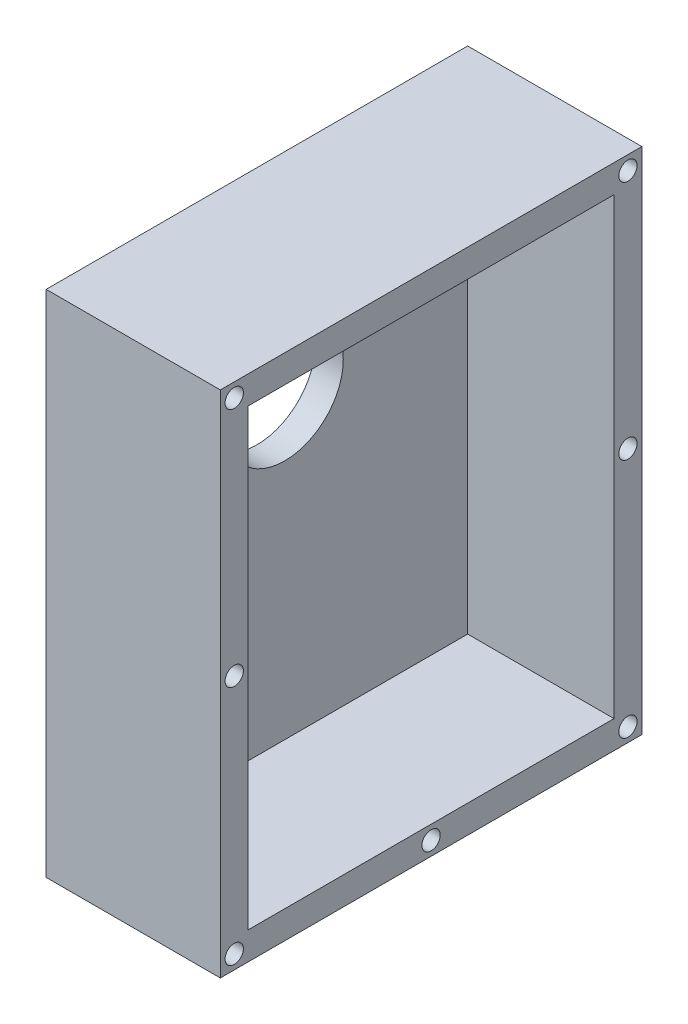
ISO-10303-21;
HEADER;
FILE_DESCRIPTION(('STEP AP214'),'2;1');
FILE_NAME('part.step','',(''),(''),'','','');
FILE_SCHEMA(('AUTOMOTIVE_DESIGN { 1 0 10303 214 1 1 1 1 }'));
ENDSEC;
DATA;
#1=APPLICATION_CONTEXT('core data for automotive mechanical design processes');
#2=APPLICATION_PROTOCOL_DEFINITION('international standard','automotive_design',2000,#1);
#3=PRODUCT_CONTEXT('',#1,'mechanical');
#4=PRODUCT('Part','Part','',(#3));
#5=PRODUCT_RELATED_PRODUCT_CATEGORY('part','',(#4));
#6=PRODUCT_DEFINITION_FORMATION('','',#4);
#7=PRODUCT_DEFINITION_CONTEXT('part definition',#1,'design');
#8=PRODUCT_DEFINITION('design','',#6,#7);
#9=PRODUCT_DEFINITION_SHAPE('','',#8);
#10=(LENGTH_UNIT() NAMED_UNIT(*) SI_UNIT(.MILLI.,.METRE.));
#11=(NAMED_UNIT(*) PLANE_ANGLE_UNIT() SI_UNIT($,.RADIAN.));
#12=(NAMED_UNIT(*) SI_UNIT($,.STERADIAN.) SOLID_ANGLE_UNIT());
#13=UNCERTAINTY_MEASURE_WITH_UNIT(LENGTH_MEASURE(1.E-05),#10,'distance_accuracy_value','');
#14=(GEOMETRIC_REPRESENTATION_CONTEXT(3) GLOBAL_UNCERTAINTY_ASSIGNED_CONTEXT((#13)) GLOBAL_UNIT_ASSIGNED_CONTEXT((#10,
#11,#12)) REPRESENTATION_CONTEXT('',''));
#15=CARTESIAN_POINT('',(0.,0.,0.));
#16=DIRECTION('',(0.,0.,1.));
#17=DIRECTION('',(1.,0.,0.));
#18=AXIS2_PLACEMENT_3D('',#15,#16,#17);
#19=CARTESIAN_POINT('',(12.7,0.,0.));
#20=DIRECTION('',(-1.,0.,0.));
#21=DIRECTION('',(0.,0.,1.));
#22=AXIS2_PLACEMENT_3D('',#19,#20,#21);
#23=PLANE('',#22);
#24=CARTESIAN_POINT('',(12.7,19.685,32.9565));
#25=DIRECTION('',(1.,0.,0.));
#26=DIRECTION('',(0.,0.,-1.));
#27=AXIS2_PLACEMENT_3D('',#24,#25,#26);
#28=CIRCLE('',#27,0.793749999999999);
#29=CARTESIAN_POINT('',(12.7,19.685,32.16275));
#30=VERTEX_POINT('',#29);
#31=EDGE_CURVE('E423',#30,#30,#28,.T.);
#32=ORIENTED_EDGE('',*,*,#31,.F.);
#33=EDGE_LOOP('',(#32));
#34=FACE_BOUND('',#33,.T.);
#35=CARTESIAN_POINT('',(12.7,-1.20650000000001,32.9565));
#36=DIRECTION('',(1.,0.,0.));
#37=DIRECTION('',(0.,0.,-1.));
#38=AXIS2_PLACEMENT_3D('',#35,#36,#37);
#39=CIRCLE('',#38,0.79375);
#40=CARTESIAN_POINT('',(12.7,-1.20650000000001,32.16275));
#41=VERTEX_POINT('',#40);
#42=EDGE_CURVE('E424',#41,#41,#39,.T.);
#43=ORIENTED_EDGE('',*,*,#42,.F.);
#44=EDGE_LOOP('',(#43));
#45=FACE_BOUND('',#44,.T.);
#46=CARTESIAN_POINT('',(12.7,-1.20650000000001,15.875));
#47=DIRECTION('',(1.,0.,0.));
#48=DIRECTION('',(0.,0.,-1.));
#49=AXIS2_PLACEMENT_3D('',#46,#47,#48);
#50=CIRCLE('',#49,0.79375);
#51=CARTESIAN_POINT('',(12.7,-1.20650000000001,15.08125));
#52=VERTEX_POINT('',#51);
#53=EDGE_CURVE('E436',#52,#52,#50,.T.);
#54=ORIENTED_EDGE('',*,*,#53,.F.);
#55=EDGE_LOOP('',(#54));
#56=FACE_BOUND('',#55,.T.);
#57=CARTESIAN_POINT('',(12.7,-1.20650000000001,-1.2065));
#58=DIRECTION('',(1.,0.,0.));
#59=DIRECTION('',(0.,0.,-1.));
#60=AXIS2_PLACEMENT_3D('',#57,#58,#59);
#61=CIRCLE('',#60,0.79375);
#62=CARTESIAN_POINT('',(12.7,-1.20650000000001,-2.00025));
#63=VERTEX_POINT('',#62);
#64=EDGE_CURVE('E442',#63,#63,#61,.T.);
#65=ORIENTED_EDGE('',*,*,#64,.F.);
#66=EDGE_LOOP('',(#65));
#67=FACE_BOUND('',#66,.T.);
#68=CARTESIAN_POINT('',(12.7,19.685,-1.2065));
#69=DIRECTION('',(1.,0.,0.));
#70=DIRECTION('',(0.,0.,-1.));
#71=AXIS2_PLACEMENT_3D('',#68,#69,#70);
#72=CIRCLE('',#71,0.793749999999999);
#73=CARTESIAN_POINT('',(12.7,19.685,-2.00025));
#74=VERTEX_POINT('',#73);
#75=EDGE_CURVE('E448',#74,#74,#72,.T.);
#76=ORIENTED_EDGE('',*,*,#75,.F.);
#77=EDGE_LOOP('',(#76));
#78=FACE_BOUND('',#77,.T.);
#79=CARTESIAN_POINT('',(12.7,40.5765,-1.2065));
#80=DIRECTION('',(1.,0.,0.));
#81=DIRECTION('',(0.,0.,-1.));
#82=AXIS2_PLACEMENT_3D('',#79,#80,#81);
#83=CIRCLE('',#82,0.79375);
#84=CARTESIAN_POINT('',(12.7,40.5765,-2.00025));
#85=VERTEX_POINT('',#84);
#86=EDGE_CURVE('E471',#85,#85,#83,.T.);
#87=ORIENTED_EDGE('',*,*,#86,.F.);
#88=EDGE_LOOP('',(#87));
#89=FACE_BOUND('',#88,.T.);
#90=CARTESIAN_POINT('',(12.7,40.5765,32.9565));
#91=DIRECTION('',(1.,0.,0.));
#92=DIRECTION('',(0.,0.,-1.));
#93=AXIS2_PLACEMENT_3D('',#90,#91,#92);
#94=CIRCLE('',#93,0.793749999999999);
#95=CARTESIAN_POINT('',(12.7,40.5765,32.16275));
#96=VERTEX_POINT('',#95);
#97=EDGE_CURVE('E427',#96,#96,#94,.T.);
#98=ORIENTED_EDGE('',*,*,#97,.F.);
#99=EDGE_LOOP('',(#98));
#100=FACE_BOUND('',#99,.T.);
#101=DIRECTION('',(0.,0.,-1.));
#102=VECTOR('',#101,1.);
#103=CARTESIAN_POINT('',(12.7,-2.413,0.));
#104=LINE('',#103,#102);
#105=CARTESIAN_POINT('',(12.7,-2.41300000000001,34.163));
#106=VERTEX_POINT('',#105);
#107=CARTESIAN_POINT('',(12.7,-2.413,-2.413));
#108=VERTEX_POINT('',#107);
#109=EDGE_CURVE('E170',#106,#108,#104,.T.);
#110=ORIENTED_EDGE('',*,*,#109,.T.);
#111=DIRECTION('',(0.,1.,0.));
#112=VECTOR('',#111,1.);
#113=CARTESIAN_POINT('',(12.7,0.,-2.413));
#114=LINE('',#113,#112);
#115=CARTESIAN_POINT('',(12.7,41.783,-2.413));
#116=VERTEX_POINT('',#115);
#117=EDGE_CURVE('E172',#108,#116,#114,.T.);
#118=ORIENTED_EDGE('',*,*,#117,.T.);
#119=DIRECTION('',(0.,0.,1.));
#120=VECTOR('',#119,1.);
#121=CARTESIAN_POINT('',(12.7,41.783,0.));
#122=LINE('',#121,#120);
#123=CARTESIAN_POINT('',(12.7,41.783,34.163));
#124=VERTEX_POINT('',#123);
#125=EDGE_CURVE('E174',#116,#124,#122,.T.);
#126=ORIENTED_EDGE('',*,*,#125,.T.);
#127=DIRECTION('',(0.,-1.,0.));
#128=VECTOR('',#127,1.);
#129=CARTESIAN_POINT('',(12.7,0.,34.163));
#130=LINE('',#129,#128);
#131=EDGE_CURVE('E70',#124,#106,#130,.T.);
#132=ORIENTED_EDGE('',*,*,#131,.T.);
#133=EDGE_LOOP('',(#110,#118,#126,#132));
#134=FACE_BOUND('',#133,.T.);
#135=DIRECTION('',(0.,0.,-1.));
#136=VECTOR('',#135,1.);
#137=CARTESIAN_POINT('',(12.7,0.,0.));
#138=LINE('',#137,#136);
#139=CARTESIAN_POINT('',(12.7,0.,31.75));
#140=VERTEX_POINT('',#139);
#141=CARTESIAN_POINT('',(12.7,0.,0.));
#142=VERTEX_POINT('',#141);
#143=EDGE_CURVE('E115',#140,#142,#138,.T.);
#144=ORIENTED_EDGE('',*,*,#143,.F.);
#145=DIRECTION('',(0.,-1.,0.));
#146=VECTOR('',#145,1.);
#147=CARTESIAN_POINT('',(12.7,0.,31.75));
#148=LINE('',#147,#146);
#149=CARTESIAN_POINT('',(12.7,39.37,31.75));
#150=VERTEX_POINT('',#149);
#151=EDGE_CURVE('E140',#150,#140,#148,.T.);
#152=ORIENTED_EDGE('',*,*,#151,.F.);
#153=DIRECTION('',(0.,0.,1.));
#154=VECTOR('',#153,1.);
#155=CARTESIAN_POINT('',(12.7,39.37,0.));
#156=LINE('',#155,#154);
#157=CARTESIAN_POINT('',(12.7,39.37,0.));
#158=VERTEX_POINT('',#157);
#159=EDGE_CURVE('E138',#158,#150,#156,.T.);
#160=ORIENTED_EDGE('',*,*,#159,.F.);
#161=DIRECTION('',(0.,1.,0.));
#162=VECTOR('',#161,1.);
#163=CARTESIAN_POINT('',(12.7,0.,0.));
#164=LINE('',#163,#162);
#165=EDGE_CURVE('E126',#142,#158,#164,.T.);
#166=ORIENTED_EDGE('',*,*,#165,.F.);
#167=EDGE_LOOP('',(#144,#152,#160,#166));
#168=FACE_BOUND('',#167,.T.);
#169=ADVANCED_FACE('F45',(#34,#45,#56,#67,#78,#89,#100,#134,#168),#23,.F.);
#170=CARTESIAN_POINT('',(12.7,-2.413,0.));
#171=DIRECTION('',(0.,1.,0.));
#172=DIRECTION('',(0.,0.,1.));
#173=AXIS2_PLACEMENT_3D('',#170,#171,#172);
#174=PLANE('',#173);
#175=DIRECTION('',(0.,0.,-1.));
#176=VECTOR('',#175,1.);
#177=CARTESIAN_POINT('',(-2.413,-2.413,0.));
#178=LINE('',#177,#176);
#179=CARTESIAN_POINT('',(-2.413,-2.41300000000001,34.163));
#180=VERTEX_POINT('',#179);
#181=CARTESIAN_POINT('',(-2.413,-2.413,-2.413));
#182=VERTEX_POINT('',#181);
#183=EDGE_CURVE('E134',#180,#182,#178,.T.);
#184=ORIENTED_EDGE('',*,*,#183,.T.);
#185=DIRECTION('',(-1.,0.,0.));
#186=VECTOR('',#185,1.);
#187=CARTESIAN_POINT('',(12.7,-2.413,-2.413));
#188=LINE('',#187,#186);
#189=EDGE_CURVE('E11',#108,#182,#188,.T.);
#190=ORIENTED_EDGE('',*,*,#189,.F.);
#191=ORIENTED_EDGE('',*,*,#109,.F.);
#192=DIRECTION('',(-1.,0.,0.));
#193=VECTOR('',#192,1.);
#194=CARTESIAN_POINT('',(12.7,-2.41300000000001,34.163));
#195=LINE('',#194,#193);
#196=EDGE_CURVE('E157',#106,#180,#195,.T.);
#197=ORIENTED_EDGE('',*,*,#196,.T.);
#198=EDGE_LOOP('',(#184,#190,#191,#197));
#199=FACE_BOUND('',#198,.T.);
#200=ADVANCED_FACE('F188',(#199),#174,.F.);
#201=CARTESIAN_POINT('',(12.7,0.,-2.413));
#202=DIRECTION('',(0.,0.,1.));
#203=DIRECTION('',(1.,0.,0.));
#204=AXIS2_PLACEMENT_3D('',#201,#202,#203);
#205=PLANE('',#204);
#206=DIRECTION('',(0.,1.,0.));
#207=VECTOR('',#206,1.);
#208=CARTESIAN_POINT('',(-2.413,0.,-2.413));
#209=LINE('',#208,#207);
#210=CARTESIAN_POINT('',(-2.413,41.783,-2.413));
#211=VERTEX_POINT('',#210);
#212=EDGE_CURVE('E155',#182,#211,#209,.T.);
#213=ORIENTED_EDGE('',*,*,#212,.T.);
#214=DIRECTION('',(-1.,0.,0.));
#215=VECTOR('',#214,1.);
#216=CARTESIAN_POINT('',(12.7,41.783,-2.413));
#217=LINE('',#216,#215);
#218=EDGE_CURVE('E54',#116,#211,#217,.T.);
#219=ORIENTED_EDGE('',*,*,#218,.F.);
#220=ORIENTED_EDGE('',*,*,#117,.F.);
#221=ORIENTED_EDGE('',*,*,#189,.T.);
#222=EDGE_LOOP('',(#213,#219,#220,#221));
#223=FACE_BOUND('',#222,.T.);
#224=ADVANCED_FACE('F190',(#223),#205,.F.);
#225=CARTESIAN_POINT('',(12.7,41.783,0.));
#226=DIRECTION('',(0.,-1.,0.));
#227=DIRECTION('',(0.,0.,-1.));
#228=AXIS2_PLACEMENT_3D('',#225,#226,#227);
#229=PLANE('',#228);
#230=DIRECTION('',(0.,0.,1.));
#231=VECTOR('',#230,1.);
#232=CARTESIAN_POINT('',(-2.413,41.783,0.));
#233=LINE('',#232,#231);
#234=CARTESIAN_POINT('',(-2.413,41.783,34.163));
#235=VERTEX_POINT('',#234);
#236=EDGE_CURVE('E162',#211,#235,#233,.T.);
#237=ORIENTED_EDGE('',*,*,#236,.T.);
#238=DIRECTION('',(-1.,0.,0.));
#239=VECTOR('',#238,1.);
#240=CARTESIAN_POINT('',(12.7,41.783,34.163));
#241=LINE('',#240,#239);
#242=EDGE_CURVE('E160',#124,#235,#241,.T.);
#243=ORIENTED_EDGE('',*,*,#242,.F.);
#244=ORIENTED_EDGE('',*,*,#125,.F.);
#245=ORIENTED_EDGE('',*,*,#218,.T.);
#246=EDGE_LOOP('',(#237,#243,#244,#245));
#247=FACE_BOUND('',#246,.T.);
#248=ADVANCED_FACE('F179',(#247),#229,.F.);
#249=CARTESIAN_POINT('',(12.7,0.,34.163));
#250=DIRECTION('',(0.,0.,-1.));
#251=DIRECTION('',(-1.,0.,0.));
#252=AXIS2_PLACEMENT_3D('',#249,#250,#251);
#253=PLANE('',#252);
#254=DIRECTION('',(0.,-1.,0.));
#255=VECTOR('',#254,1.);
#256=CARTESIAN_POINT('',(-2.413,0.,34.163));
#257=LINE('',#256,#255);
#258=EDGE_CURVE('E166',#235,#180,#257,.T.);
#259=ORIENTED_EDGE('',*,*,#258,.T.);
#260=ORIENTED_EDGE('',*,*,#196,.F.);
#261=ORIENTED_EDGE('',*,*,#131,.F.);
#262=ORIENTED_EDGE('',*,*,#242,.T.);
#263=EDGE_LOOP('',(#259,#260,#261,#262));
#264=FACE_BOUND('',#263,.T.);
#265=ADVANCED_FACE('F183',(#264),#253,.F.);
#266=CARTESIAN_POINT('',(-2.413,0.,0.));
#267=DIRECTION('',(-1.,0.,0.));
#268=DIRECTION('',(0.,0.,1.));
#269=AXIS2_PLACEMENT_3D('',#266,#267,#268);
#270=PLANE('',#269);
#271=CARTESIAN_POINT('',(-2.413,26.035,15.875));
#272=DIRECTION('',(1.,0.,0.));
#273=DIRECTION('',(0.,0.,-1.));
#274=AXIS2_PLACEMENT_3D('',#271,#272,#273);
#275=CIRCLE('',#274,5.08);
#276=CARTESIAN_POINT('',(-2.413,26.035,10.795));
#277=VERTEX_POINT('',#276);
#278=EDGE_CURVE('E452',#277,#277,#275,.T.);
#279=ORIENTED_EDGE('',*,*,#278,.T.);
#280=EDGE_LOOP('',(#279));
#281=FACE_BOUND('',#280,.T.);
#282=ORIENTED_EDGE('',*,*,#183,.F.);
#283=ORIENTED_EDGE('',*,*,#258,.F.);
#284=ORIENTED_EDGE('',*,*,#236,.F.);
#285=ORIENTED_EDGE('',*,*,#212,.F.);
#286=EDGE_LOOP('',(#282,#283,#284,#285));
#287=FACE_BOUND('',#286,.T.);
#288=ADVANCED_FACE('F47',(#281,#287),#270,.T.);
#289=CARTESIAN_POINT('',(12.7,0.,0.));
#290=DIRECTION('',(0.,1.,0.));
#291=DIRECTION('',(0.,0.,1.));
#292=AXIS2_PLACEMENT_3D('',#289,#290,#291);
#293=PLANE('',#292);
#294=DIRECTION('',(0.,0.,-1.));
#295=VECTOR('',#294,1.);
#296=CARTESIAN_POINT('',(0.,0.,0.));
#297=LINE('',#296,#295);
#298=CARTESIAN_POINT('',(0.,0.,31.75));
#299=VERTEX_POINT('',#298);
#300=CARTESIAN_POINT('',(0.,0.,0.));
#301=VERTEX_POINT('',#300);
#302=EDGE_CURVE('E145',#299,#301,#297,.T.);
#303=ORIENTED_EDGE('',*,*,#302,.F.);
#304=DIRECTION('',(-1.,0.,0.));
#305=VECTOR('',#304,1.);
#306=CARTESIAN_POINT('',(12.7,0.,31.75));
#307=LINE('',#306,#305);
#308=EDGE_CURVE('E122',#140,#299,#307,.T.);
#309=ORIENTED_EDGE('',*,*,#308,.F.);
#310=ORIENTED_EDGE('',*,*,#143,.T.);
#311=DIRECTION('',(-1.,0.,0.));
#312=VECTOR('',#311,1.);
#313=CARTESIAN_POINT('',(12.7,0.,0.));
#314=LINE('',#313,#312);
#315=EDGE_CURVE('E119',#142,#301,#314,.T.);
#316=ORIENTED_EDGE('',*,*,#315,.T.);
#317=EDGE_LOOP('',(#303,#309,#310,#316));
#318=FACE_BOUND('',#317,.T.);
#319=ADVANCED_FACE('F118',(#318),#293,.T.);
#320=CARTESIAN_POINT('',(12.7,0.,0.));
#321=DIRECTION('',(0.,0.,1.));
#322=DIRECTION('',(1.,0.,0.));
#323=AXIS2_PLACEMENT_3D('',#320,#321,#322);
#324=PLANE('',#323);
#325=DIRECTION('',(0.,1.,0.));
#326=VECTOR('',#325,1.);
#327=CARTESIAN_POINT('',(0.,0.,0.));
#328=LINE('',#327,#326);
#329=CARTESIAN_POINT('',(0.,39.37,0.));
#330=VERTEX_POINT('',#329);
#331=EDGE_CURVE('E133',#301,#330,#328,.T.);
#332=ORIENTED_EDGE('',*,*,#331,.F.);
#333=ORIENTED_EDGE('',*,*,#315,.F.);
#334=ORIENTED_EDGE('',*,*,#165,.T.);
#335=DIRECTION('',(-1.,0.,0.));
#336=VECTOR('',#335,1.);
#337=CARTESIAN_POINT('',(12.7,39.37,0.));
#338=LINE('',#337,#336);
#339=EDGE_CURVE('E135',#158,#330,#338,.T.);
#340=ORIENTED_EDGE('',*,*,#339,.T.);
#341=EDGE_LOOP('',(#332,#333,#334,#340));
#342=FACE_BOUND('',#341,.T.);
#343=ADVANCED_FACE('F130',(#342),#324,.T.);
#344=CARTESIAN_POINT('',(12.7,39.37,0.));
#345=DIRECTION('',(0.,-1.,0.));
#346=DIRECTION('',(0.,0.,-1.));
#347=AXIS2_PLACEMENT_3D('',#344,#345,#346);
#348=PLANE('',#347);
#349=DIRECTION('',(0.,0.,1.));
#350=VECTOR('',#349,1.);
#351=CARTESIAN_POINT('',(0.,39.37,0.));
#352=LINE('',#351,#350);
#353=CARTESIAN_POINT('',(0.,39.37,31.75));
#354=VERTEX_POINT('',#353);
#355=EDGE_CURVE('E148',#330,#354,#352,.T.);
#356=ORIENTED_EDGE('',*,*,#355,.F.);
#357=ORIENTED_EDGE('',*,*,#339,.F.);
#358=ORIENTED_EDGE('',*,*,#159,.T.);
#359=DIRECTION('',(-1.,0.,0.));
#360=VECTOR('',#359,1.);
#361=CARTESIAN_POINT('',(12.7,39.37,31.75));
#362=LINE('',#361,#360);
#363=EDGE_CURVE('E62',#150,#354,#362,.T.);
#364=ORIENTED_EDGE('',*,*,#363,.T.);
#365=EDGE_LOOP('',(#356,#357,#358,#364));
#366=FACE_BOUND('',#365,.T.);
#367=ADVANCED_FACE('F239',(#366),#348,.T.);
#368=CARTESIAN_POINT('',(12.7,0.,31.75));
#369=DIRECTION('',(0.,0.,-1.));
#370=DIRECTION('',(-1.,0.,0.));
#371=AXIS2_PLACEMENT_3D('',#368,#369,#370);
#372=PLANE('',#371);
#373=DIRECTION('',(0.,-1.,0.));
#374=VECTOR('',#373,1.);
#375=CARTESIAN_POINT('',(0.,0.,31.75));
#376=LINE('',#375,#374);
#377=EDGE_CURVE('E127',#354,#299,#376,.T.);
#378=ORIENTED_EDGE('',*,*,#377,.F.);
#379=ORIENTED_EDGE('',*,*,#363,.F.);
#380=ORIENTED_EDGE('',*,*,#151,.T.);
#381=ORIENTED_EDGE('',*,*,#308,.T.);
#382=EDGE_LOOP('',(#378,#379,#380,#381));
#383=FACE_BOUND('',#382,.T.);
#384=ADVANCED_FACE('F247',(#383),#372,.T.);
#385=CARTESIAN_POINT('',(0.,0.,0.));
#386=DIRECTION('',(-1.,0.,0.));
#387=DIRECTION('',(0.,0.,1.));
#388=AXIS2_PLACEMENT_3D('',#385,#386,#387);
#389=PLANE('',#388);
#390=CARTESIAN_POINT('',(0.,26.035,15.875));
#391=DIRECTION('',(-1.,0.,0.));
#392=DIRECTION('',(0.,0.,1.));
#393=AXIS2_PLACEMENT_3D('',#390,#391,#392);
#394=CIRCLE('',#393,5.08);
#395=CARTESIAN_POINT('',(0.,26.035,20.955));
#396=VERTEX_POINT('',#395);
#397=EDGE_CURVE('E49',#396,#396,#394,.T.);
#398=ORIENTED_EDGE('',*,*,#397,.T.);
#399=EDGE_LOOP('',(#398));
#400=FACE_BOUND('',#399,.T.);
#401=ORIENTED_EDGE('',*,*,#302,.T.);
#402=ORIENTED_EDGE('',*,*,#331,.T.);
#403=ORIENTED_EDGE('',*,*,#355,.T.);
#404=ORIENTED_EDGE('',*,*,#377,.T.);
#405=EDGE_LOOP('',(#401,#402,#403,#404));
#406=FACE_BOUND('',#405,.T.);
#407=ADVANCED_FACE('F254',(#400,#406),#389,.F.);
#408=CARTESIAN_POINT('',(-2.413,26.035,15.875));
#409=DIRECTION('',(1.,0.,0.));
#410=DIRECTION('',(0.,0.,-1.));
#411=AXIS2_PLACEMENT_3D('',#408,#409,#410);
#412=CYLINDRICAL_SURFACE('',#411,5.08);
#413=ORIENTED_EDGE('',*,*,#278,.F.);
#414=EDGE_LOOP('',(#413));
#415=FACE_BOUND('',#414,.T.);
#416=ORIENTED_EDGE('',*,*,#397,.F.);
#417=EDGE_LOOP('',(#416));
#418=FACE_BOUND('',#417,.T.);
#419=ADVANCED_FACE('F261',(#415,#418),#412,.F.);
#420=CARTESIAN_POINT('',(5.08,40.5765,32.9565));
#421=DIRECTION('',(1.,0.,0.));
#422=DIRECTION('',(0.,0.,-1.));
#423=AXIS2_PLACEMENT_3D('',#420,#421,#422);
#424=CYLINDRICAL_SURFACE('',#423,0.793749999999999);
#425=CARTESIAN_POINT('',(5.08,40.5765,32.9565));
#426=DIRECTION('',(1.,0.,0.));
#427=DIRECTION('',(0.,0.,-1.));
#428=AXIS2_PLACEMENT_3D('',#425,#426,#427);
#429=CIRCLE('',#428,0.793749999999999);
#430=CARTESIAN_POINT('',(5.08,40.5765,32.16275));
#431=VERTEX_POINT('',#430);
#432=EDGE_CURVE('E449',#431,#431,#429,.T.);
#433=CARTESIAN_POINT('',(5.08,40.5765,32.16275));
#434=CARTESIAN_POINT('',(5.159375,40.5765,32.16275));
#435=CARTESIAN_POINT('',(5.23875,40.5765,32.16275));
#436=CARTESIAN_POINT('',(5.3975,40.5765,32.16275));
#437=CARTESIAN_POINT('',(5.476875,40.5765,32.16275));
#438=CARTESIAN_POINT('',(5.635625,40.5765,32.16275));
#439=CARTESIAN_POINT('',(5.715,40.5765,32.16275));
#440=CARTESIAN_POINT('',(5.87375,40.5765,32.16275));
#441=CARTESIAN_POINT('',(5.953125,40.5765,32.16275));
#442=CARTESIAN_POINT('',(6.111875,40.5765,32.16275));
#443=CARTESIAN_POINT('',(6.19125,40.5765,32.16275));
#444=CARTESIAN_POINT('',(6.35,40.5765,32.16275));
#445=CARTESIAN_POINT('',(6.429375,40.5765,32.16275));
#446=CARTESIAN_POINT('',(6.588125,40.5765,32.16275));
#447=CARTESIAN_POINT('',(6.6675,40.5765,32.16275));
#448=CARTESIAN_POINT('',(6.82625,40.5765,32.16275));
#449=CARTESIAN_POINT('',(6.905625,40.5765,32.16275));
#450=CARTESIAN_POINT('',(7.064375,40.5765,32.16275));
#451=CARTESIAN_POINT('',(7.14375,40.5765,32.16275));
#452=CARTESIAN_POINT('',(7.3025,40.5765,32.16275));
#453=CARTESIAN_POINT('',(7.381875,40.5765,32.16275));
#454=CARTESIAN_POINT('',(7.540625,40.5765,32.16275));
#455=CARTESIAN_POINT('',(7.62,40.5765,32.16275));
#456=CARTESIAN_POINT('',(7.77875,40.5765,32.16275));
#457=CARTESIAN_POINT('',(7.858125,40.5765,32.16275));
#458=CARTESIAN_POINT('',(8.016875,40.5765,32.16275));
#459=CARTESIAN_POINT('',(8.09625,40.5765,32.16275));
#460=CARTESIAN_POINT('',(8.255,40.5765,32.16275));
#461=CARTESIAN_POINT('',(8.334375,40.5765,32.16275));
#462=CARTESIAN_POINT('',(8.493125,40.5765,32.16275));
#463=CARTESIAN_POINT('',(8.5725,40.5765,32.16275));
#464=CARTESIAN_POINT('',(8.73125,40.5765,32.16275));
#465=CARTESIAN_POINT('',(8.810625,40.5765,32.16275));
#466=CARTESIAN_POINT('',(8.969375,40.5765,32.16275));
#467=CARTESIAN_POINT('',(9.04875,40.5765,32.16275));
#468=CARTESIAN_POINT('',(9.2075,40.5765,32.16275));
#469=CARTESIAN_POINT('',(9.286875,40.5765,32.16275));
#470=CARTESIAN_POINT('',(9.445625,40.5765,32.16275));
#471=CARTESIAN_POINT('',(9.525,40.5765,32.16275));
#472=CARTESIAN_POINT('',(9.68375,40.5765,32.16275));
#473=CARTESIAN_POINT('',(9.763125,40.5765,32.16275));
#474=CARTESIAN_POINT('',(9.921875,40.5765,32.16275));
#475=CARTESIAN_POINT('',(10.00125,40.5765,32.16275));
#476=CARTESIAN_POINT('',(10.16,40.5765,32.16275));
#477=CARTESIAN_POINT('',(10.239375,40.5765,32.16275));
#478=CARTESIAN_POINT('',(10.398125,40.5765,32.16275));
#479=CARTESIAN_POINT('',(10.4775,40.5765,32.16275));
#480=CARTESIAN_POINT('',(10.63625,40.5765,32.16275));
#481=CARTESIAN_POINT('',(10.715625,40.5765,32.16275));
#482=CARTESIAN_POINT('',(10.874375,40.5765,32.16275));
#483=CARTESIAN_POINT('',(10.95375,40.5765,32.16275));
#484=CARTESIAN_POINT('',(11.1125,40.5765,32.16275));
#485=CARTESIAN_POINT('',(11.191875,40.5765,32.16275));
#486=CARTESIAN_POINT('',(11.350625,40.5765,32.16275));
#487=CARTESIAN_POINT('',(11.43,40.5765,32.16275));
#488=CARTESIAN_POINT('',(11.58875,40.5765,32.16275));
#489=CARTESIAN_POINT('',(11.668125,40.5765,32.16275));
#490=CARTESIAN_POINT('',(11.826875,40.5765,32.16275));
#491=CARTESIAN_POINT('',(11.90625,40.5765,32.16275));
#492=CARTESIAN_POINT('',(12.065,40.5765,32.16275));
#493=CARTESIAN_POINT('',(12.144375,40.5765,32.16275));
#494=CARTESIAN_POINT('',(12.303125,40.5765,32.16275));
#495=CARTESIAN_POINT('',(12.3825,40.5765,32.16275));
#496=CARTESIAN_POINT('',(12.54125,40.5765,32.16275));
#497=CARTESIAN_POINT('',(12.620625,40.5765,32.16275));
#498=CARTESIAN_POINT('',(12.7,40.5765,32.16275));
#499=B_SPLINE_CURVE_WITH_KNOTS('',3,(#433,#434,#435,#436,#437,#438,#439,#440,#441,#442,#443,
#444,#445,#446,#447,#448,#449,#450,#451,#452,#453,#454,#455,#456,#457,#458,#459,#460,#461,#462,
#463,#464,#465,#466,#467,#468,#469,#470,#471,#472,#473,#474,#475,#476,#477,#478,#479,#480,#481,
#482,#483,#484,#485,#486,#487,#488,#489,#490,#491,#492,#493,#494,#495,#496,#497,#498),
.UNSPECIFIED.,.F.,.F.,(4,2,2,2,2,2,2,2,2,2,2,2,2,2,2,2,2,2,2,2,2,2,2,2,2,2,2,2,2,2,2,2,4),(0.,
0.238125,0.47625,0.714375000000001,0.9525,1.190625,1.42875,1.666875,1.905,2.143125,2.38125,
2.619375,2.8575,3.095625,3.33375,3.571875,3.81,4.048125,4.28625,4.524375,4.7625,5.000625,
5.23875,5.476875,5.715,5.953125,6.19125,6.429375,6.6675,6.905625,7.14375,7.381875,7.62),.UNSPECIFIED.);
#500=EDGE_CURVE('BSEAM271',#431,#96,#499,.T.);
#501=ORIENTED_EDGE('',*,*,#432,.F.);
#502=ORIENTED_EDGE('',*,*,#97,.T.);
#503=ORIENTED_EDGE('',*,*,#500,.T.);
#504=ORIENTED_EDGE('',*,*,#500,.F.);
#505=EDGE_LOOP('',(#501,#503,#502,#504));
#506=FACE_BOUND('',#505,.T.);
#507=ADVANCED_FACE('F271',(#506),#424,.F.);
#508=CARTESIAN_POINT('',(5.08,40.5765,32.9565));
#509=DIRECTION('',(1.,0.,0.));
#510=DIRECTION('',(0.,0.,-1.));
#511=AXIS2_PLACEMENT_3D('',#508,#509,#510);
#512=PLANE('',#511);
#513=ORIENTED_EDGE('',*,*,#432,.T.);
#514=EDGE_LOOP('',(#513));
#515=FACE_BOUND('',#514,.T.);
#516=ADVANCED_FACE('F284',(#515),#512,.T.);
#517=CARTESIAN_POINT('',(5.08,40.5765,-1.2065));
#518=DIRECTION('',(1.,0.,0.));
#519=DIRECTION('',(0.,0.,-1.));
#520=AXIS2_PLACEMENT_3D('',#517,#518,#519);
#521=CYLINDRICAL_SURFACE('',#520,0.79375);
#522=CARTESIAN_POINT('',(5.08,40.5765,-1.2065));
#523=DIRECTION('',(1.,0.,0.));
#524=DIRECTION('',(0.,0.,-1.));
#525=AXIS2_PLACEMENT_3D('',#522,#523,#524);
#526=CIRCLE('',#525,0.79375);
#527=CARTESIAN_POINT('',(5.08,40.5765,-2.00025));
#528=VERTEX_POINT('',#527);
#529=EDGE_CURVE('E475',#528,#528,#526,.T.);
#530=CARTESIAN_POINT('',(5.08,40.5765,-2.00025));
#531=CARTESIAN_POINT('',(5.159375,40.5765,-2.00025));
#532=CARTESIAN_POINT('',(5.23875,40.5765,-2.00025));
#533=CARTESIAN_POINT('',(5.3975,40.5765,-2.00025));
#534=CARTESIAN_POINT('',(5.476875,40.5765,-2.00025));
#535=CARTESIAN_POINT('',(5.635625,40.5765,-2.00025));
#536=CARTESIAN_POINT('',(5.715,40.5765,-2.00025));
#537=CARTESIAN_POINT('',(5.87375,40.5765,-2.00025));
#538=CARTESIAN_POINT('',(5.953125,40.5765,-2.00025));
#539=CARTESIAN_POINT('',(6.111875,40.5765,-2.00025));
#540=CARTESIAN_POINT('',(6.19125,40.5765,-2.00025));
#541=CARTESIAN_POINT('',(6.35,40.5765,-2.00025));
#542=CARTESIAN_POINT('',(6.429375,40.5765,-2.00025));
#543=CARTESIAN_POINT('',(6.588125,40.5765,-2.00025));
#544=CARTESIAN_POINT('',(6.6675,40.5765,-2.00025));
#545=CARTESIAN_POINT('',(6.82625,40.5765,-2.00025));
#546=CARTESIAN_POINT('',(6.905625,40.5765,-2.00025));
#547=CARTESIAN_POINT('',(7.064375,40.5765,-2.00025));
#548=CARTESIAN_POINT('',(7.14375,40.5765,-2.00025));
#549=CARTESIAN_POINT('',(7.3025,40.5765,-2.00025));
#550=CARTESIAN_POINT('',(7.381875,40.5765,-2.00025));
#551=CARTESIAN_POINT('',(7.540625,40.5765,-2.00025));
#552=CARTESIAN_POINT('',(7.62,40.5765,-2.00025));
#553=CARTESIAN_POINT('',(7.77875,40.5765,-2.00025));
#554=CARTESIAN_POINT('',(7.858125,40.5765,-2.00025));
#555=CARTESIAN_POINT('',(8.016875,40.5765,-2.00025));
#556=CARTESIAN_POINT('',(8.09625,40.5765,-2.00025));
#557=CARTESIAN_POINT('',(8.255,40.5765,-2.00025));
#558=CARTESIAN_POINT('',(8.334375,40.5765,-2.00025));
#559=CARTESIAN_POINT('',(8.493125,40.5765,-2.00025));
#560=CARTESIAN_POINT('',(8.5725,40.5765,-2.00025));
#561=CARTESIAN_POINT('',(8.73125,40.5765,-2.00025));
#562=CARTESIAN_POINT('',(8.810625,40.5765,-2.00025));
#563=CARTESIAN_POINT('',(8.969375,40.5765,-2.00025));
#564=CARTESIAN_POINT('',(9.04875,40.5765,-2.00025));
#565=CARTESIAN_POINT('',(9.2075,40.5765,-2.00025));
#566=CARTESIAN_POINT('',(9.286875,40.5765,-2.00025));
#567=CARTESIAN_POINT('',(9.445625,40.5765,-2.00025));
#568=CARTESIAN_POINT('',(9.525,40.5765,-2.00025));
#569=CARTESIAN_POINT('',(9.68375,40.5765,-2.00025));
#570=CARTESIAN_POINT('',(9.763125,40.5765,-2.00025));
#571=CARTESIAN_POINT('',(9.921875,40.5765,-2.00025));
#572=CARTESIAN_POINT('',(10.00125,40.5765,-2.00025));
#573=CARTESIAN_POINT('',(10.16,40.5765,-2.00025));
#574=CARTESIAN_POINT('',(10.239375,40.5765,-2.00025));
#575=CARTESIAN_POINT('',(10.398125,40.5765,-2.00025));
#576=CARTESIAN_POINT('',(10.4775,40.5765,-2.00025));
#577=CARTESIAN_POINT('',(10.63625,40.5765,-2.00025));
#578=CARTESIAN_POINT('',(10.715625,40.5765,-2.00025));
#579=CARTESIAN_POINT('',(10.874375,40.5765,-2.00025));
#580=CARTESIAN_POINT('',(10.95375,40.5765,-2.00025));
#581=CARTESIAN_POINT('',(11.1125,40.5765,-2.00025));
#582=CARTESIAN_POINT('',(11.191875,40.5765,-2.00025));
#583=CARTESIAN_POINT('',(11.350625,40.5765,-2.00025));
#584=CARTESIAN_POINT('',(11.43,40.5765,-2.00025));
#585=CARTESIAN_POINT('',(11.58875,40.5765,-2.00025));
#586=CARTESIAN_POINT('',(11.668125,40.5765,-2.00025));
#587=CARTESIAN_POINT('',(11.826875,40.5765,-2.00025));
#588=CARTESIAN_POINT('',(11.90625,40.5765,-2.00025));
#589=CARTESIAN_POINT('',(12.065,40.5765,-2.00025));
#590=CARTESIAN_POINT('',(12.144375,40.5765,-2.00025));
#591=CARTESIAN_POINT('',(12.303125,40.5765,-2.00025));
#592=CARTESIAN_POINT('',(12.3825,40.5765,-2.00025));
#593=CARTESIAN_POINT('',(12.54125,40.5765,-2.00025));
#594=CARTESIAN_POINT('',(12.620625,40.5765,-2.00025));
#595=CARTESIAN_POINT('',(12.7,40.5765,-2.00025));
#596=B_SPLINE_CURVE_WITH_KNOTS('',3,(#530,#531,#532,#533,#534,#535,#536,#537,#538,#539,#540,
#541,#542,#543,#544,#545,#546,#547,#548,#549,#550,#551,#552,#553,#554,#555,#556,#557,#558,#559,
#560,#561,#562,#563,#564,#565,#566,#567,#568,#569,#570,#571,#572,#573,#574,#575,#576,#577,#578,
#579,#580,#581,#582,#583,#584,#585,#586,#587,#588,#589,#590,#591,#592,#593,#594,#595),
.UNSPECIFIED.,.F.,.F.,(4,2,2,2,2,2,2,2,2,2,2,2,2,2,2,2,2,2,2,2,2,2,2,2,2,2,2,2,2,2,2,2,4),(0.,
0.238125,0.47625,0.714375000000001,0.9525,1.190625,1.42875,1.666875,1.905,2.143125,2.38125,
2.619375,2.8575,3.095625,3.33375,3.571875,3.81,4.048125,4.28625,4.524375,4.7625,5.000625,
5.23875,5.476875,5.715,5.953125,6.19125,6.429375,6.6675,6.905625,7.14375,7.381875,7.62),.UNSPECIFIED.);
#597=EDGE_CURVE('BSEAM293',#528,#85,#596,.T.);
#598=ORIENTED_EDGE('',*,*,#529,.F.);
#599=ORIENTED_EDGE('',*,*,#86,.T.);
#600=ORIENTED_EDGE('',*,*,#597,.T.);
#601=ORIENTED_EDGE('',*,*,#597,.F.);
#602=EDGE_LOOP('',(#598,#600,#599,#601));
#603=FACE_BOUND('',#602,.T.);
#604=ADVANCED_FACE('F293',(#603),#521,.F.);
#605=CARTESIAN_POINT('',(5.08,40.5765,-1.2065));
#606=DIRECTION('',(1.,0.,0.));
#607=DIRECTION('',(0.,0.,-1.));
#608=AXIS2_PLACEMENT_3D('',#605,#606,#607);
#609=PLANE('',#608);
#610=ORIENTED_EDGE('',*,*,#529,.T.);
#611=EDGE_LOOP('',(#610));
#612=FACE_BOUND('',#611,.T.);
#613=ADVANCED_FACE('F302',(#612),#609,.T.);
#614=CARTESIAN_POINT('',(5.08,19.685,-1.2065));
#615=DIRECTION('',(1.,0.,0.));
#616=DIRECTION('',(0.,0.,-1.));
#617=AXIS2_PLACEMENT_3D('',#614,#615,#616);
#618=CYLINDRICAL_SURFACE('',#617,0.793749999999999);
#619=CARTESIAN_POINT('',(5.08,19.685,-1.2065));
#620=DIRECTION('',(1.,0.,0.));
#621=DIRECTION('',(0.,0.,-1.));
#622=AXIS2_PLACEMENT_3D('',#619,#620,#621);
#623=CIRCLE('',#622,0.793749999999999);
#624=CARTESIAN_POINT('',(5.08,19.685,-2.00025));
#625=VERTEX_POINT('',#624);
#626=EDGE_CURVE('E466',#625,#625,#623,.T.);
#627=CARTESIAN_POINT('',(5.08,19.685,-2.00025));
#628=CARTESIAN_POINT('',(5.159375,19.685,-2.00025));
#629=CARTESIAN_POINT('',(5.23875,19.685,-2.00025));
#630=CARTESIAN_POINT('',(5.3975,19.685,-2.00025));
#631=CARTESIAN_POINT('',(5.476875,19.685,-2.00025));
#632=CARTESIAN_POINT('',(5.635625,19.685,-2.00025));
#633=CARTESIAN_POINT('',(5.715,19.685,-2.00025));
#634=CARTESIAN_POINT('',(5.87375,19.685,-2.00025));
#635=CARTESIAN_POINT('',(5.953125,19.685,-2.00025));
#636=CARTESIAN_POINT('',(6.111875,19.685,-2.00025));
#637=CARTESIAN_POINT('',(6.19125,19.685,-2.00025));
#638=CARTESIAN_POINT('',(6.35,19.685,-2.00025));
#639=CARTESIAN_POINT('',(6.429375,19.685,-2.00025));
#640=CARTESIAN_POINT('',(6.588125,19.685,-2.00025));
#641=CARTESIAN_POINT('',(6.6675,19.685,-2.00025));
#642=CARTESIAN_POINT('',(6.82625,19.685,-2.00025));
#643=CARTESIAN_POINT('',(6.905625,19.685,-2.00025));
#644=CARTESIAN_POINT('',(7.064375,19.685,-2.00025));
#645=CARTESIAN_POINT('',(7.14375,19.685,-2.00025));
#646=CARTESIAN_POINT('',(7.3025,19.685,-2.00025));
#647=CARTESIAN_POINT('',(7.381875,19.685,-2.00025));
#648=CARTESIAN_POINT('',(7.540625,19.685,-2.00025));
#649=CARTESIAN_POINT('',(7.62,19.685,-2.00025));
#650=CARTESIAN_POINT('',(7.77875,19.685,-2.00025));
#651=CARTESIAN_POINT('',(7.858125,19.685,-2.00025));
#652=CARTESIAN_POINT('',(8.016875,19.685,-2.00025));
#653=CARTESIAN_POINT('',(8.09625,19.685,-2.00025));
#654=CARTESIAN_POINT('',(8.255,19.685,-2.00025));
#655=CARTESIAN_POINT('',(8.334375,19.685,-2.00025));
#656=CARTESIAN_POINT('',(8.493125,19.685,-2.00025));
#657=CARTESIAN_POINT('',(8.5725,19.685,-2.00025));
#658=CARTESIAN_POINT('',(8.73125,19.685,-2.00025));
#659=CARTESIAN_POINT('',(8.810625,19.685,-2.00025));
#660=CARTESIAN_POINT('',(8.969375,19.685,-2.00025));
#661=CARTESIAN_POINT('',(9.04875,19.685,-2.00025));
#662=CARTESIAN_POINT('',(9.2075,19.685,-2.00025));
#663=CARTESIAN_POINT('',(9.286875,19.685,-2.00025));
#664=CARTESIAN_POINT('',(9.445625,19.685,-2.00025));
#665=CARTESIAN_POINT('',(9.525,19.685,-2.00025));
#666=CARTESIAN_POINT('',(9.68375,19.685,-2.00025));
#667=CARTESIAN_POINT('',(9.763125,19.685,-2.00025));
#668=CARTESIAN_POINT('',(9.921875,19.685,-2.00025));
#669=CARTESIAN_POINT('',(10.00125,19.685,-2.00025));
#670=CARTESIAN_POINT('',(10.16,19.685,-2.00025));
#671=CARTESIAN_POINT('',(10.239375,19.685,-2.00025));
#672=CARTESIAN_POINT('',(10.398125,19.685,-2.00025));
#673=CARTESIAN_POINT('',(10.4775,19.685,-2.00025));
#674=CARTESIAN_POINT('',(10.63625,19.685,-2.00025));
#675=CARTESIAN_POINT('',(10.715625,19.685,-2.00025));
#676=CARTESIAN_POINT('',(10.874375,19.685,-2.00025));
#677=CARTESIAN_POINT('',(10.95375,19.685,-2.00025));
#678=CARTESIAN_POINT('',(11.1125,19.685,-2.00025));
#679=CARTESIAN_POINT('',(11.191875,19.685,-2.00025));
#680=CARTESIAN_POINT('',(11.350625,19.685,-2.00025));
#681=CARTESIAN_POINT('',(11.43,19.685,-2.00025));
#682=CARTESIAN_POINT('',(11.58875,19.685,-2.00025));
#683=CARTESIAN_POINT('',(11.668125,19.685,-2.00025));
#684=CARTESIAN_POINT('',(11.826875,19.685,-2.00025));
#685=CARTESIAN_POINT('',(11.90625,19.685,-2.00025));
#686=CARTESIAN_POINT('',(12.065,19.685,-2.00025));
#687=CARTESIAN_POINT('',(12.144375,19.685,-2.00025));
#688=CARTESIAN_POINT('',(12.303125,19.685,-2.00025));
#689=CARTESIAN_POINT('',(12.3825,19.685,-2.00025));
#690=CARTESIAN_POINT('',(12.54125,19.685,-2.00025));
#691=CARTESIAN_POINT('',(12.620625,19.685,-2.00025));
#692=CARTESIAN_POINT('',(12.7,19.685,-2.00025));
#693=B_SPLINE_CURVE_WITH_KNOTS('',3,(#627,#628,#629,#630,#631,#632,#633,#634,#635,#636,#637,
#638,#639,#640,#641,#642,#643,#644,#645,#646,#647,#648,#649,#650,#651,#652,#653,#654,#655,#656,
#657,#658,#659,#660,#661,#662,#663,#664,#665,#666,#667,#668,#669,#670,#671,#672,#673,#674,#675,
#676,#677,#678,#679,#680,#681,#682,#683,#684,#685,#686,#687,#688,#689,#690,#691,#692),
.UNSPECIFIED.,.F.,.F.,(4,2,2,2,2,2,2,2,2,2,2,2,2,2,2,2,2,2,2,2,2,2,2,2,2,2,2,2,2,2,2,2,4),(0.,
0.238125,0.47625,0.714375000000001,0.9525,1.190625,1.42875,1.666875,1.905,2.143125,2.38125,
2.619375,2.8575,3.095625,3.33375,3.571875,3.81,4.048125,4.28625,4.524375,4.7625,5.000625,
5.23875,5.476875,5.715,5.953125,6.19125,6.429375,6.6675,6.905625,7.14375,7.381875,7.62),.UNSPECIFIED.);
#694=EDGE_CURVE('BSEAM311',#625,#74,#693,.T.);
#695=ORIENTED_EDGE('',*,*,#626,.F.);
#696=ORIENTED_EDGE('',*,*,#75,.T.);
#697=ORIENTED_EDGE('',*,*,#694,.T.);
#698=ORIENTED_EDGE('',*,*,#694,.F.);
#699=EDGE_LOOP('',(#695,#697,#696,#698));
#700=FACE_BOUND('',#699,.T.);
#701=ADVANCED_FACE('F311',(#700),#618,.F.);
#702=CARTESIAN_POINT('',(5.08,19.685,-1.2065));
#703=DIRECTION('',(1.,0.,0.));
#704=DIRECTION('',(0.,0.,-1.));
#705=AXIS2_PLACEMENT_3D('',#702,#703,#704);
#706=PLANE('',#705);
#707=ORIENTED_EDGE('',*,*,#626,.T.);
#708=EDGE_LOOP('',(#707));
#709=FACE_BOUND('',#708,.T.);
#710=ADVANCED_FACE('F320',(#709),#706,.T.);
#711=CARTESIAN_POINT('',(5.08,-1.20650000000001,-1.2065));
#712=DIRECTION('',(1.,0.,0.));
#713=DIRECTION('',(0.,0.,-1.));
#714=AXIS2_PLACEMENT_3D('',#711,#712,#713);
#715=CYLINDRICAL_SURFACE('',#714,0.79375);
#716=CARTESIAN_POINT('',(5.08,-1.20650000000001,-1.2065));
#717=DIRECTION('',(1.,0.,0.));
#718=DIRECTION('',(0.,0.,-1.));
#719=AXIS2_PLACEMENT_3D('',#716,#717,#718);
#720=CIRCLE('',#719,0.79375);
#721=CARTESIAN_POINT('',(5.08,-1.20650000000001,-2.00025));
#722=VERTEX_POINT('',#721);
#723=EDGE_CURVE('E445',#722,#722,#720,.T.);
#724=CARTESIAN_POINT('',(5.08,-1.20650000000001,-2.00025));
#725=CARTESIAN_POINT('',(5.159375,-1.20650000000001,-2.00025));
#726=CARTESIAN_POINT('',(5.23875,-1.20650000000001,-2.00025));
#727=CARTESIAN_POINT('',(5.3975,-1.20650000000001,-2.00025));
#728=CARTESIAN_POINT('',(5.476875,-1.20650000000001,-2.00025));
#729=CARTESIAN_POINT('',(5.635625,-1.20650000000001,-2.00025));
#730=CARTESIAN_POINT('',(5.715,-1.20650000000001,-2.00025));
#731=CARTESIAN_POINT('',(5.87375,-1.20650000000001,-2.00025));
#732=CARTESIAN_POINT('',(5.953125,-1.20650000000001,-2.00025));
#733=CARTESIAN_POINT('',(6.111875,-1.20650000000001,-2.00025));
#734=CARTESIAN_POINT('',(6.19125,-1.20650000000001,-2.00025));
#735=CARTESIAN_POINT('',(6.35,-1.20650000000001,-2.00025));
#736=CARTESIAN_POINT('',(6.429375,-1.20650000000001,-2.00025));
#737=CARTESIAN_POINT('',(6.588125,-1.20650000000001,-2.00025));
#738=CARTESIAN_POINT('',(6.6675,-1.20650000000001,-2.00025));
#739=CARTESIAN_POINT('',(6.82625,-1.20650000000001,-2.00025));
#740=CARTESIAN_POINT('',(6.905625,-1.20650000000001,-2.00025));
#741=CARTESIAN_POINT('',(7.064375,-1.20650000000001,-2.00025));
#742=CARTESIAN_POINT('',(7.14375,-1.20650000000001,-2.00025));
#743=CARTESIAN_POINT('',(7.3025,-1.20650000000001,-2.00025));
#744=CARTESIAN_POINT('',(7.381875,-1.20650000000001,-2.00025));
#745=CARTESIAN_POINT('',(7.540625,-1.20650000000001,-2.00025));
#746=CARTESIAN_POINT('',(7.62,-1.20650000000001,-2.00025));
#747=CARTESIAN_POINT('',(7.77875,-1.20650000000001,-2.00025));
#748=CARTESIAN_POINT('',(7.858125,-1.20650000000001,-2.00025));
#749=CARTESIAN_POINT('',(8.016875,-1.20650000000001,-2.00025));
#750=CARTESIAN_POINT('',(8.09625,-1.20650000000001,-2.00025));
#751=CARTESIAN_POINT('',(8.255,-1.20650000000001,-2.00025));
#752=CARTESIAN_POINT('',(8.334375,-1.20650000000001,-2.00025));
#753=CARTESIAN_POINT('',(8.493125,-1.20650000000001,-2.00025));
#754=CARTESIAN_POINT('',(8.5725,-1.20650000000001,-2.00025));
#755=CARTESIAN_POINT('',(8.73125,-1.20650000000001,-2.00025));
#756=CARTESIAN_POINT('',(8.810625,-1.20650000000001,-2.00025));
#757=CARTESIAN_POINT('',(8.969375,-1.20650000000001,-2.00025));
#758=CARTESIAN_POINT('',(9.04875,-1.20650000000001,-2.00025));
#759=CARTESIAN_POINT('',(9.2075,-1.20650000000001,-2.00025));
#760=CARTESIAN_POINT('',(9.286875,-1.20650000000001,-2.00025));
#761=CARTESIAN_POINT('',(9.445625,-1.20650000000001,-2.00025));
#762=CARTESIAN_POINT('',(9.525,-1.20650000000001,-2.00025));
#763=CARTESIAN_POINT('',(9.68375,-1.20650000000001,-2.00025));
#764=CARTESIAN_POINT('',(9.763125,-1.20650000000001,-2.00025));
#765=CARTESIAN_POINT('',(9.921875,-1.20650000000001,-2.00025));
#766=CARTESIAN_POINT('',(10.00125,-1.20650000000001,-2.00025));
#767=CARTESIAN_POINT('',(10.16,-1.20650000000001,-2.00025));
#768=CARTESIAN_POINT('',(10.239375,-1.20650000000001,-2.00025));
#769=CARTESIAN_POINT('',(10.398125,-1.20650000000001,-2.00025));
#770=CARTESIAN_POINT('',(10.4775,-1.20650000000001,-2.00025));
#771=CARTESIAN_POINT('',(10.63625,-1.20650000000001,-2.00025));
#772=CARTESIAN_POINT('',(10.715625,-1.20650000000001,-2.00025));
#773=CARTESIAN_POINT('',(10.874375,-1.20650000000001,-2.00025));
#774=CARTESIAN_POINT('',(10.95375,-1.20650000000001,-2.00025));
#775=CARTESIAN_POINT('',(11.1125,-1.20650000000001,-2.00025));
#776=CARTESIAN_POINT('',(11.191875,-1.20650000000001,-2.00025));
#777=CARTESIAN_POINT('',(11.350625,-1.20650000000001,-2.00025));
#778=CARTESIAN_POINT('',(11.43,-1.20650000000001,-2.00025));
#779=CARTESIAN_POINT('',(11.58875,-1.20650000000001,-2.00025));
#780=CARTESIAN_POINT('',(11.668125,-1.20650000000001,-2.00025));
#781=CARTESIAN_POINT('',(11.826875,-1.20650000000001,-2.00025));
#782=CARTESIAN_POINT('',(11.90625,-1.20650000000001,-2.00025));
#783=CARTESIAN_POINT('',(12.065,-1.20650000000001,-2.00025));
#784=CARTESIAN_POINT('',(12.144375,-1.20650000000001,-2.00025));
#785=CARTESIAN_POINT('',(12.303125,-1.20650000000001,-2.00025));
#786=CARTESIAN_POINT('',(12.3825,-1.20650000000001,-2.00025));
#787=CARTESIAN_POINT('',(12.54125,-1.20650000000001,-2.00025));
#788=CARTESIAN_POINT('',(12.620625,-1.20650000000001,-2.00025));
#789=CARTESIAN_POINT('',(12.7,-1.20650000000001,-2.00025));
#790=B_SPLINE_CURVE_WITH_KNOTS('',3,(#724,#725,#726,#727,#728,#729,#730,#731,#732,#733,#734,
#735,#736,#737,#738,#739,#740,#741,#742,#743,#744,#745,#746,#747,#748,#749,#750,#751,#752,#753,
#754,#755,#756,#757,#758,#759,#760,#761,#762,#763,#764,#765,#766,#767,#768,#769,#770,#771,#772,
#773,#774,#775,#776,#777,#778,#779,#780,#781,#782,#783,#784,#785,#786,#787,#788,#789),
.UNSPECIFIED.,.F.,.F.,(4,2,2,2,2,2,2,2,2,2,2,2,2,2,2,2,2,2,2,2,2,2,2,2,2,2,2,2,2,2,2,2,4),(0.,
0.238125,0.47625,0.714375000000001,0.9525,1.190625,1.42875,1.666875,1.905,2.143125,2.38125,
2.619375,2.8575,3.095625,3.33375,3.571875,3.81,4.048125,4.28625,4.524375,4.7625,5.000625,
5.23875,5.476875,5.715,5.953125,6.19125,6.429375,6.6675,6.905625,7.14375,7.381875,7.62),.UNSPECIFIED.);
#791=EDGE_CURVE('BSEAM329',#722,#63,#790,.T.);
#792=ORIENTED_EDGE('',*,*,#723,.F.);
#793=ORIENTED_EDGE('',*,*,#64,.T.);
#794=ORIENTED_EDGE('',*,*,#791,.T.);
#795=ORIENTED_EDGE('',*,*,#791,.F.);
#796=EDGE_LOOP('',(#792,#794,#793,#795));
#797=FACE_BOUND('',#796,.T.);
#798=ADVANCED_FACE('F329',(#797),#715,.F.);
#799=CARTESIAN_POINT('',(5.08,-1.20650000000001,-1.2065));
#800=DIRECTION('',(1.,0.,0.));
#801=DIRECTION('',(0.,0.,-1.));
#802=AXIS2_PLACEMENT_3D('',#799,#800,#801);
#803=PLANE('',#802);
#804=ORIENTED_EDGE('',*,*,#723,.T.);
#805=EDGE_LOOP('',(#804));
#806=FACE_BOUND('',#805,.T.);
#807=ADVANCED_FACE('F338',(#806),#803,.T.);
#808=CARTESIAN_POINT('',(5.08,-1.20650000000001,15.875));
#809=DIRECTION('',(1.,0.,0.));
#810=DIRECTION('',(0.,0.,-1.));
#811=AXIS2_PLACEMENT_3D('',#808,#809,#810);
#812=CYLINDRICAL_SURFACE('',#811,0.79375);
#813=CARTESIAN_POINT('',(5.08,-1.20650000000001,15.875));
#814=DIRECTION('',(1.,0.,0.));
#815=DIRECTION('',(0.,0.,-1.));
#816=AXIS2_PLACEMENT_3D('',#813,#814,#815);
#817=CIRCLE('',#816,0.79375);
#818=CARTESIAN_POINT('',(5.08,-1.20650000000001,15.08125));
#819=VERTEX_POINT('',#818);
#820=EDGE_CURVE('E439',#819,#819,#817,.T.);
#821=CARTESIAN_POINT('',(5.08,-1.20650000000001,15.08125));
#822=CARTESIAN_POINT('',(5.159375,-1.20650000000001,15.08125));
#823=CARTESIAN_POINT('',(5.23875,-1.20650000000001,15.08125));
#824=CARTESIAN_POINT('',(5.3975,-1.20650000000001,15.08125));
#825=CARTESIAN_POINT('',(5.476875,-1.20650000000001,15.08125));
#826=CARTESIAN_POINT('',(5.635625,-1.20650000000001,15.08125));
#827=CARTESIAN_POINT('',(5.715,-1.20650000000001,15.08125));
#828=CARTESIAN_POINT('',(5.87375,-1.20650000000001,15.08125));
#829=CARTESIAN_POINT('',(5.953125,-1.20650000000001,15.08125));
#830=CARTESIAN_POINT('',(6.111875,-1.20650000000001,15.08125));
#831=CARTESIAN_POINT('',(6.19125,-1.20650000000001,15.08125));
#832=CARTESIAN_POINT('',(6.35,-1.20650000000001,15.08125));
#833=CARTESIAN_POINT('',(6.429375,-1.20650000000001,15.08125));
#834=CARTESIAN_POINT('',(6.588125,-1.20650000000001,15.08125));
#835=CARTESIAN_POINT('',(6.6675,-1.20650000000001,15.08125));
#836=CARTESIAN_POINT('',(6.82625,-1.20650000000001,15.08125));
#837=CARTESIAN_POINT('',(6.905625,-1.20650000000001,15.08125));
#838=CARTESIAN_POINT('',(7.064375,-1.20650000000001,15.08125));
#839=CARTESIAN_POINT('',(7.14375,-1.20650000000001,15.08125));
#840=CARTESIAN_POINT('',(7.3025,-1.20650000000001,15.08125));
#841=CARTESIAN_POINT('',(7.381875,-1.20650000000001,15.08125));
#842=CARTESIAN_POINT('',(7.540625,-1.20650000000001,15.08125));
#843=CARTESIAN_POINT('',(7.62,-1.20650000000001,15.08125));
#844=CARTESIAN_POINT('',(7.77875,-1.20650000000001,15.08125));
#845=CARTESIAN_POINT('',(7.858125,-1.20650000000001,15.08125));
#846=CARTESIAN_POINT('',(8.016875,-1.20650000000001,15.08125));
#847=CARTESIAN_POINT('',(8.09625,-1.20650000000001,15.08125));
#848=CARTESIAN_POINT('',(8.255,-1.20650000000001,15.08125));
#849=CARTESIAN_POINT('',(8.334375,-1.20650000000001,15.08125));
#850=CARTESIAN_POINT('',(8.493125,-1.20650000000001,15.08125));
#851=CARTESIAN_POINT('',(8.5725,-1.20650000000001,15.08125));
#852=CARTESIAN_POINT('',(8.73125,-1.20650000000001,15.08125));
#853=CARTESIAN_POINT('',(8.810625,-1.20650000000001,15.08125));
#854=CARTESIAN_POINT('',(8.969375,-1.20650000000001,15.08125));
#855=CARTESIAN_POINT('',(9.04875,-1.20650000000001,15.08125));
#856=CARTESIAN_POINT('',(9.2075,-1.20650000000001,15.08125));
#857=CARTESIAN_POINT('',(9.286875,-1.20650000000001,15.08125));
#858=CARTESIAN_POINT('',(9.445625,-1.20650000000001,15.08125));
#859=CARTESIAN_POINT('',(9.525,-1.20650000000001,15.08125));
#860=CARTESIAN_POINT('',(9.68375,-1.20650000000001,15.08125));
#861=CARTESIAN_POINT('',(9.763125,-1.20650000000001,15.08125));
#862=CARTESIAN_POINT('',(9.921875,-1.20650000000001,15.08125));
#863=CARTESIAN_POINT('',(10.00125,-1.20650000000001,15.08125));
#864=CARTESIAN_POINT('',(10.16,-1.20650000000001,15.08125));
#865=CARTESIAN_POINT('',(10.239375,-1.20650000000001,15.08125));
#866=CARTESIAN_POINT('',(10.398125,-1.20650000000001,15.08125));
#867=CARTESIAN_POINT('',(10.4775,-1.20650000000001,15.08125));
#868=CARTESIAN_POINT('',(10.63625,-1.20650000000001,15.08125));
#869=CARTESIAN_POINT('',(10.715625,-1.20650000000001,15.08125));
#870=CARTESIAN_POINT('',(10.874375,-1.20650000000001,15.08125));
#871=CARTESIAN_POINT('',(10.95375,-1.20650000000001,15.08125));
#872=CARTESIAN_POINT('',(11.1125,-1.20650000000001,15.08125));
#873=CARTESIAN_POINT('',(11.191875,-1.20650000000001,15.08125));
#874=CARTESIAN_POINT('',(11.350625,-1.20650000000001,15.08125));
#875=CARTESIAN_POINT('',(11.43,-1.20650000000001,15.08125));
#876=CARTESIAN_POINT('',(11.58875,-1.20650000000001,15.08125));
#877=CARTESIAN_POINT('',(11.668125,-1.20650000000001,15.08125));
#878=CARTESIAN_POINT('',(11.826875,-1.20650000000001,15.08125));
#879=CARTESIAN_POINT('',(11.90625,-1.20650000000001,15.08125));
#880=CARTESIAN_POINT('',(12.065,-1.20650000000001,15.08125));
#881=CARTESIAN_POINT('',(12.144375,-1.20650000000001,15.08125));
#882=CARTESIAN_POINT('',(12.303125,-1.20650000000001,15.08125));
#883=CARTESIAN_POINT('',(12.3825,-1.20650000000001,15.08125));
#884=CARTESIAN_POINT('',(12.54125,-1.20650000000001,15.08125));
#885=CARTESIAN_POINT('',(12.620625,-1.20650000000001,15.08125));
#886=CARTESIAN_POINT('',(12.7,-1.20650000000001,15.08125));
#887=B_SPLINE_CURVE_WITH_KNOTS('',3,(#821,#822,#823,#824,#825,#826,#827,#828,#829,#830,#831,
#832,#833,#834,#835,#836,#837,#838,#839,#840,#841,#842,#843,#844,#845,#846,#847,#848,#849,#850,
#851,#852,#853,#854,#855,#856,#857,#858,#859,#860,#861,#862,#863,#864,#865,#866,#867,#868,#869,
#870,#871,#872,#873,#874,#875,#876,#877,#878,#879,#880,#881,#882,#883,#884,#885,#886),
.UNSPECIFIED.,.F.,.F.,(4,2,2,2,2,2,2,2,2,2,2,2,2,2,2,2,2,2,2,2,2,2,2,2,2,2,2,2,2,2,2,2,4),(0.,
0.238125,0.47625,0.714375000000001,0.9525,1.190625,1.42875,1.666875,1.905,2.143125,2.38125,
2.619375,2.8575,3.095625,3.33375,3.571875,3.81,4.048125,4.28625,4.524375,4.7625,5.000625,
5.23875,5.476875,5.715,5.953125,6.19125,6.429375,6.6675,6.905625,7.14375,7.381875,7.62),.UNSPECIFIED.);
#888=EDGE_CURVE('BSEAM347',#819,#52,#887,.T.);
#889=ORIENTED_EDGE('',*,*,#820,.F.);
#890=ORIENTED_EDGE('',*,*,#53,.T.);
#891=ORIENTED_EDGE('',*,*,#888,.T.);
#892=ORIENTED_EDGE('',*,*,#888,.F.);
#893=EDGE_LOOP('',(#889,#891,#890,#892));
#894=FACE_BOUND('',#893,.T.);
#895=ADVANCED_FACE('F347',(#894),#812,.F.);
#896=CARTESIAN_POINT('',(5.08,-1.20650000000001,15.875));
#897=DIRECTION('',(1.,0.,0.));
#898=DIRECTION('',(0.,0.,-1.));
#899=AXIS2_PLACEMENT_3D('',#896,#897,#898);
#900=PLANE('',#899);
#901=ORIENTED_EDGE('',*,*,#820,.T.);
#902=EDGE_LOOP('',(#901));
#903=FACE_BOUND('',#902,.T.);
#904=ADVANCED_FACE('F356',(#903),#900,.T.);
#905=CARTESIAN_POINT('',(5.08,-1.20650000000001,32.9565));
#906=DIRECTION('',(1.,0.,0.));
#907=DIRECTION('',(0.,0.,-1.));
#908=AXIS2_PLACEMENT_3D('',#905,#906,#907);
#909=CYLINDRICAL_SURFACE('',#908,0.79375);
#910=CARTESIAN_POINT('',(5.08,-1.20650000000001,32.9565));
#911=DIRECTION('',(1.,0.,0.));
#912=DIRECTION('',(0.,0.,-1.));
#913=AXIS2_PLACEMENT_3D('',#910,#911,#912);
#914=CIRCLE('',#913,0.79375);
#915=CARTESIAN_POINT('',(5.08,-1.20650000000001,32.16275));
#916=VERTEX_POINT('',#915);
#917=EDGE_CURVE('E430',#916,#916,#914,.T.);
#918=CARTESIAN_POINT('',(5.08,-1.20650000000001,32.16275));
#919=CARTESIAN_POINT('',(5.159375,-1.20650000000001,32.16275));
#920=CARTESIAN_POINT('',(5.23875,-1.20650000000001,32.16275));
#921=CARTESIAN_POINT('',(5.3975,-1.20650000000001,32.16275));
#922=CARTESIAN_POINT('',(5.476875,-1.20650000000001,32.16275));
#923=CARTESIAN_POINT('',(5.635625,-1.20650000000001,32.16275));
#924=CARTESIAN_POINT('',(5.715,-1.20650000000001,32.16275));
#925=CARTESIAN_POINT('',(5.87375,-1.20650000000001,32.16275));
#926=CARTESIAN_POINT('',(5.953125,-1.20650000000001,32.16275));
#927=CARTESIAN_POINT('',(6.111875,-1.20650000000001,32.16275));
#928=CARTESIAN_POINT('',(6.19125,-1.20650000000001,32.16275));
#929=CARTESIAN_POINT('',(6.35,-1.20650000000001,32.16275));
#930=CARTESIAN_POINT('',(6.429375,-1.20650000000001,32.16275));
#931=CARTESIAN_POINT('',(6.588125,-1.20650000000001,32.16275));
#932=CARTESIAN_POINT('',(6.6675,-1.20650000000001,32.16275));
#933=CARTESIAN_POINT('',(6.82625,-1.20650000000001,32.16275));
#934=CARTESIAN_POINT('',(6.905625,-1.20650000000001,32.16275));
#935=CARTESIAN_POINT('',(7.064375,-1.20650000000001,32.16275));
#936=CARTESIAN_POINT('',(7.14375,-1.20650000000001,32.16275));
#937=CARTESIAN_POINT('',(7.3025,-1.20650000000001,32.16275));
#938=CARTESIAN_POINT('',(7.381875,-1.20650000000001,32.16275));
#939=CARTESIAN_POINT('',(7.540625,-1.20650000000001,32.16275));
#940=CARTESIAN_POINT('',(7.62,-1.20650000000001,32.16275));
#941=CARTESIAN_POINT('',(7.77875,-1.20650000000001,32.16275));
#942=CARTESIAN_POINT('',(7.858125,-1.20650000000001,32.16275));
#943=CARTESIAN_POINT('',(8.016875,-1.20650000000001,32.16275));
#944=CARTESIAN_POINT('',(8.09625,-1.20650000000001,32.16275));
#945=CARTESIAN_POINT('',(8.255,-1.20650000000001,32.16275));
#946=CARTESIAN_POINT('',(8.334375,-1.20650000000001,32.16275));
#947=CARTESIAN_POINT('',(8.493125,-1.20650000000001,32.16275));
#948=CARTESIAN_POINT('',(8.5725,-1.20650000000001,32.16275));
#949=CARTESIAN_POINT('',(8.73125,-1.20650000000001,32.16275));
#950=CARTESIAN_POINT('',(8.810625,-1.20650000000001,32.16275));
#951=CARTESIAN_POINT('',(8.969375,-1.20650000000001,32.16275));
#952=CARTESIAN_POINT('',(9.04875,-1.20650000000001,32.16275));
#953=CARTESIAN_POINT('',(9.2075,-1.20650000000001,32.16275));
#954=CARTESIAN_POINT('',(9.286875,-1.20650000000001,32.16275));
#955=CARTESIAN_POINT('',(9.445625,-1.20650000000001,32.16275));
#956=CARTESIAN_POINT('',(9.525,-1.20650000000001,32.16275));
#957=CARTESIAN_POINT('',(9.68375,-1.20650000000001,32.16275));
#958=CARTESIAN_POINT('',(9.763125,-1.20650000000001,32.16275));
#959=CARTESIAN_POINT('',(9.921875,-1.20650000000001,32.16275));
#960=CARTESIAN_POINT('',(10.00125,-1.20650000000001,32.16275));
#961=CARTESIAN_POINT('',(10.16,-1.20650000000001,32.16275));
#962=CARTESIAN_POINT('',(10.239375,-1.20650000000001,32.16275));
#963=CARTESIAN_POINT('',(10.398125,-1.20650000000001,32.16275));
#964=CARTESIAN_POINT('',(10.4775,-1.20650000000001,32.16275));
#965=CARTESIAN_POINT('',(10.63625,-1.20650000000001,32.16275));
#966=CARTESIAN_POINT('',(10.715625,-1.20650000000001,32.16275));
#967=CARTESIAN_POINT('',(10.874375,-1.20650000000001,32.16275));
#968=CARTESIAN_POINT('',(10.95375,-1.20650000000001,32.16275));
#969=CARTESIAN_POINT('',(11.1125,-1.20650000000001,32.16275));
#970=CARTESIAN_POINT('',(11.191875,-1.20650000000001,32.16275));
#971=CARTESIAN_POINT('',(11.350625,-1.20650000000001,32.16275));
#972=CARTESIAN_POINT('',(11.43,-1.20650000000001,32.16275));
#973=CARTESIAN_POINT('',(11.58875,-1.20650000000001,32.16275));
#974=CARTESIAN_POINT('',(11.668125,-1.20650000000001,32.16275));
#975=CARTESIAN_POINT('',(11.826875,-1.20650000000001,32.16275));
#976=CARTESIAN_POINT('',(11.90625,-1.20650000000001,32.16275));
#977=CARTESIAN_POINT('',(12.065,-1.20650000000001,32.16275));
#978=CARTESIAN_POINT('',(12.144375,-1.20650000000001,32.16275));
#979=CARTESIAN_POINT('',(12.303125,-1.20650000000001,32.16275));
#980=CARTESIAN_POINT('',(12.3825,-1.20650000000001,32.16275));
#981=CARTESIAN_POINT('',(12.54125,-1.20650000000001,32.16275));
#982=CARTESIAN_POINT('',(12.620625,-1.20650000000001,32.16275));
#983=CARTESIAN_POINT('',(12.7,-1.20650000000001,32.16275));
#984=B_SPLINE_CURVE_WITH_KNOTS('',3,(#918,#919,#920,#921,#922,#923,#924,#925,#926,#927,#928,
#929,#930,#931,#932,#933,#934,#935,#936,#937,#938,#939,#940,#941,#942,#943,#944,#945,#946,#947,
#948,#949,#950,#951,#952,#953,#954,#955,#956,#957,#958,#959,#960,#961,#962,#963,#964,#965,#966,
#967,#968,#969,#970,#971,#972,#973,#974,#975,#976,#977,#978,#979,#980,#981,#982,#983),
.UNSPECIFIED.,.F.,.F.,(4,2,2,2,2,2,2,2,2,2,2,2,2,2,2,2,2,2,2,2,2,2,2,2,2,2,2,2,2,2,2,2,4),(0.,
0.238125,0.47625,0.714375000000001,0.9525,1.190625,1.42875,1.666875,1.905,2.143125,2.38125,
2.619375,2.8575,3.095625,3.33375,3.571875,3.81,4.048125,4.28625,4.524375,4.7625,5.000625,
5.23875,5.476875,5.715,5.953125,6.19125,6.429375,6.6675,6.905625,7.14375,7.381875,7.62),.UNSPECIFIED.);
#985=EDGE_CURVE('BSEAM365',#916,#41,#984,.T.);
#986=ORIENTED_EDGE('',*,*,#917,.F.);
#987=ORIENTED_EDGE('',*,*,#42,.T.);
#988=ORIENTED_EDGE('',*,*,#985,.T.);
#989=ORIENTED_EDGE('',*,*,#985,.F.);
#990=EDGE_LOOP('',(#986,#988,#987,#989));
#991=FACE_BOUND('',#990,.T.);
#992=ADVANCED_FACE('F365',(#991),#909,.F.);
#993=CARTESIAN_POINT('',(5.08,-1.20650000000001,32.9565));
#994=DIRECTION('',(1.,0.,0.));
#995=DIRECTION('',(0.,0.,-1.));
#996=AXIS2_PLACEMENT_3D('',#993,#994,#995);
#997=PLANE('',#996);
#998=ORIENTED_EDGE('',*,*,#917,.T.);
#999=EDGE_LOOP('',(#998));
#1000=FACE_BOUND('',#999,.T.);
#1001=ADVANCED_FACE('F374',(#1000),#997,.T.);
#1002=CARTESIAN_POINT('',(5.08,19.685,32.9565));
#1003=DIRECTION('',(1.,0.,0.));
#1004=DIRECTION('',(0.,0.,-1.));
#1005=AXIS2_PLACEMENT_3D('',#1002,#1003,#1004);
#1006=CYLINDRICAL_SURFACE('',#1005,0.793749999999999);
#1007=CARTESIAN_POINT('',(5.08,19.685,32.9565));
#1008=DIRECTION('',(1.,0.,0.));
#1009=DIRECTION('',(0.,0.,-1.));
#1010=AXIS2_PLACEMENT_3D('',#1007,#1008,#1009);
#1011=CIRCLE('',#1010,0.793749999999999);
#1012=CARTESIAN_POINT('',(5.08,19.685,32.16275));
#1013=VERTEX_POINT('',#1012);
#1014=EDGE_CURVE('E422',#1013,#1013,#1011,.T.);
#1015=CARTESIAN_POINT('',(5.08,19.685,32.16275));
#1016=CARTESIAN_POINT('',(5.159375,19.685,32.16275));
#1017=CARTESIAN_POINT('',(5.23875,19.685,32.16275));
#1018=CARTESIAN_POINT('',(5.3975,19.685,32.16275));
#1019=CARTESIAN_POINT('',(5.476875,19.685,32.16275));
#1020=CARTESIAN_POINT('',(5.635625,19.685,32.16275));
#1021=CARTESIAN_POINT('',(5.715,19.685,32.16275));
#1022=CARTESIAN_POINT('',(5.87375,19.685,32.16275));
#1023=CARTESIAN_POINT('',(5.953125,19.685,32.16275));
#1024=CARTESIAN_POINT('',(6.111875,19.685,32.16275));
#1025=CARTESIAN_POINT('',(6.19125,19.685,32.16275));
#1026=CARTESIAN_POINT('',(6.35,19.685,32.16275));
#1027=CARTESIAN_POINT('',(6.429375,19.685,32.16275));
#1028=CARTESIAN_POINT('',(6.588125,19.685,32.16275));
#1029=CARTESIAN_POINT('',(6.6675,19.685,32.16275));
#1030=CARTESIAN_POINT('',(6.82625,19.685,32.16275));
#1031=CARTESIAN_POINT('',(6.905625,19.685,32.16275));
#1032=CARTESIAN_POINT('',(7.064375,19.685,32.16275));
#1033=CARTESIAN_POINT('',(7.14375,19.685,32.16275));
#1034=CARTESIAN_POINT('',(7.3025,19.685,32.16275));
#1035=CARTESIAN_POINT('',(7.381875,19.685,32.16275));
#1036=CARTESIAN_POINT('',(7.540625,19.685,32.16275));
#1037=CARTESIAN_POINT('',(7.62,19.685,32.16275));
#1038=CARTESIAN_POINT('',(7.77875,19.685,32.16275));
#1039=CARTESIAN_POINT('',(7.858125,19.685,32.16275));
#1040=CARTESIAN_POINT('',(8.016875,19.685,32.16275));
#1041=CARTESIAN_POINT('',(8.09625,19.685,32.16275));
#1042=CARTESIAN_POINT('',(8.255,19.685,32.16275));
#1043=CARTESIAN_POINT('',(8.334375,19.685,32.16275));
#1044=CARTESIAN_POINT('',(8.493125,19.685,32.16275));
#1045=CARTESIAN_POINT('',(8.5725,19.685,32.16275));
#1046=CARTESIAN_POINT('',(8.73125,19.685,32.16275));
#1047=CARTESIAN_POINT('',(8.810625,19.685,32.16275));
#1048=CARTESIAN_POINT('',(8.969375,19.685,32.16275));
#1049=CARTESIAN_POINT('',(9.04875,19.685,32.16275));
#1050=CARTESIAN_POINT('',(9.2075,19.685,32.16275));
#1051=CARTESIAN_POINT('',(9.286875,19.685,32.16275));
#1052=CARTESIAN_POINT('',(9.445625,19.685,32.16275));
#1053=CARTESIAN_POINT('',(9.525,19.685,32.16275));
#1054=CARTESIAN_POINT('',(9.68375,19.685,32.16275));
#1055=CARTESIAN_POINT('',(9.763125,19.685,32.16275));
#1056=CARTESIAN_POINT('',(9.921875,19.685,32.16275));
#1057=CARTESIAN_POINT('',(10.00125,19.685,32.16275));
#1058=CARTESIAN_POINT('',(10.16,19.685,32.16275));
#1059=CARTESIAN_POINT('',(10.239375,19.685,32.16275));
#1060=CARTESIAN_POINT('',(10.398125,19.685,32.16275));
#1061=CARTESIAN_POINT('',(10.4775,19.685,32.16275));
#1062=CARTESIAN_POINT('',(10.63625,19.685,32.16275));
#1063=CARTESIAN_POINT('',(10.715625,19.685,32.16275));
#1064=CARTESIAN_POINT('',(10.874375,19.685,32.16275));
#1065=CARTESIAN_POINT('',(10.95375,19.685,32.16275));
#1066=CARTESIAN_POINT('',(11.1125,19.685,32.16275));
#1067=CARTESIAN_POINT('',(11.191875,19.685,32.16275));
#1068=CARTESIAN_POINT('',(11.350625,19.685,32.16275));
#1069=CARTESIAN_POINT('',(11.43,19.685,32.16275));
#1070=CARTESIAN_POINT('',(11.58875,19.685,32.16275));
#1071=CARTESIAN_POINT('',(11.668125,19.685,32.16275));
#1072=CARTESIAN_POINT('',(11.826875,19.685,32.16275));
#1073=CARTESIAN_POINT('',(11.90625,19.685,32.16275));
#1074=CARTESIAN_POINT('',(12.065,19.685,32.16275));
#1075=CARTESIAN_POINT('',(12.144375,19.685,32.16275));
#1076=CARTESIAN_POINT('',(12.303125,19.685,32.16275));
#1077=CARTESIAN_POINT('',(12.3825,19.685,32.16275));
#1078=CARTESIAN_POINT('',(12.54125,19.685,32.16275));
#1079=CARTESIAN_POINT('',(12.620625,19.685,32.16275));
#1080=CARTESIAN_POINT('',(12.7,19.685,32.16275));
#1081=B_SPLINE_CURVE_WITH_KNOTS('',3,(#1015,#1016,#1017,#1018,#1019,#1020,#1021,#1022,#1023,
#1024,#1025,#1026,#1027,#1028,#1029,#1030,#1031,#1032,#1033,#1034,#1035,#1036,#1037,#1038,#1039,
#1040,#1041,#1042,#1043,#1044,#1045,#1046,#1047,#1048,#1049,#1050,#1051,#1052,#1053,#1054,#1055,
#1056,#1057,#1058,#1059,#1060,#1061,#1062,#1063,#1064,#1065,#1066,#1067,#1068,#1069,#1070,#1071,
#1072,#1073,#1074,#1075,#1076,#1077,#1078,#1079,#1080),.UNSPECIFIED.,.F.,.F.,(4,2,2,2,2,2,2,2,2,
2,2,2,2,2,2,2,2,2,2,2,2,2,2,2,2,2,2,2,2,2,2,2,4),(0.,0.238125,0.47625,0.714375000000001,0.9525,
1.190625,1.42875,1.666875,1.905,2.143125,2.38125,2.619375,2.8575,3.095625,3.33375,3.571875,3.81,
4.048125,4.28625,4.524375,4.7625,5.000625,5.23875,5.476875,5.715,5.953125,6.19125,6.429375,
6.6675,6.905625,7.14375,7.381875,7.62),.UNSPECIFIED.);
#1082=EDGE_CURVE('BSEAM383',#1013,#30,#1081,.T.);
#1083=ORIENTED_EDGE('',*,*,#1014,.F.);
#1084=ORIENTED_EDGE('',*,*,#31,.T.);
#1085=ORIENTED_EDGE('',*,*,#1082,.T.);
#1086=ORIENTED_EDGE('',*,*,#1082,.F.);
#1087=EDGE_LOOP('',(#1083,#1085,#1084,#1086));
#1088=FACE_BOUND('',#1087,.T.);
#1089=ADVANCED_FACE('F383',(#1088),#1006,.F.);
#1090=CARTESIAN_POINT('',(5.08,19.685,32.9565));
#1091=DIRECTION('',(1.,0.,0.));
#1092=DIRECTION('',(0.,0.,-1.));
#1093=AXIS2_PLACEMENT_3D('',#1090,#1091,#1092);
#1094=PLANE('',#1093);
#1095=ORIENTED_EDGE('',*,*,#1014,.T.);
#1096=EDGE_LOOP('',(#1095));
#1097=FACE_BOUND('',#1096,.T.);
#1098=ADVANCED_FACE('F392',(#1097),#1094,.T.);
#1099=CLOSED_SHELL('',(#169,#200,#224,#248,#265,#288,#319,#343,#367,#384,#407,#419,#507,#516,
#604,#613,#701,#710,#798,#807,#895,#904,#992,#1001,#1089,#1098));
#1100=MANIFOLD_SOLID_BREP('B2',#1099);
#1101=ADVANCED_BREP_SHAPE_REPRESENTATION('',(#18,#1100),#14);
#1102=SHAPE_DEFINITION_REPRESENTATION(#9,#1101);
ENDSEC;
END-ISO-10303-21;
